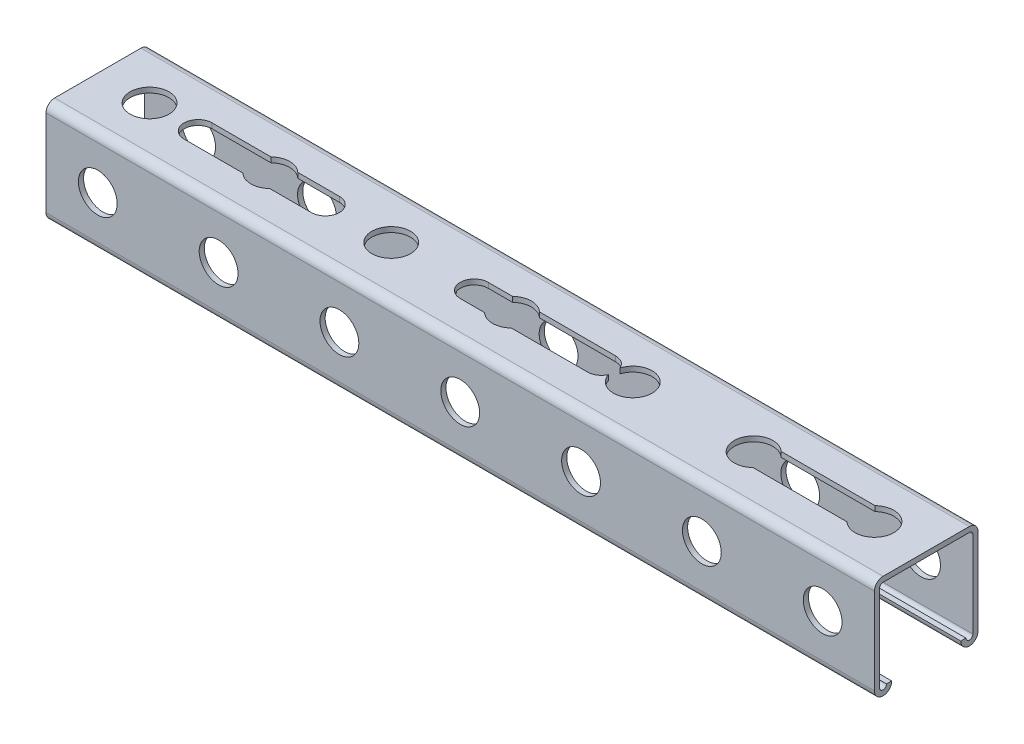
from build123d import *

# Parameters (mm, degrees)
CHANNEL_DEPTH      = 304.8
SKETCH2_R          = 7.14375
TOPHOLE_DEPTH      = 308.762168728
SKETCH3_R          = 7.14375
SIDEHOLE_DEPTH     = 570.818832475
SLOT_DEPTH         = 308.762168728
TOPHOLEPATT_COUNT  = 7
TOPHOLEPATT_PITCH  = 44.45
SIDEHOLEPATT_COUNT = 7
SIDEHOLEPATT_PITCH = 44.45
LPATTERN3_COUNT    = 3
LPATTERN3_PITCH    = 101.6


with BuildPart() as part:
    # Sketch1 → Channel (new body)
    with BuildSketch(Plane(origin=(0, 39.243400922, 0), x_dir=(0, 0, 1), z_dir=(1, 0, 0))):
        with BuildLine():
            ThreePointArc((-12.7, 74.168400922), (-15.875, 77.343400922), (-19.05, 74.168400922))
            Line((-19.05, 74.168400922), (-19.05, 42.418400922))
            ThreePointArc((-19.05, 42.418400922), (-18.12006403, 40.173336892), (-15.875, 39.243400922))
            Line((-15.875, 39.243400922), (15.875, 39.243400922))
            ThreePointArc((15.875, 39.243400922), (18.12006403, 40.173336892), (19.05, 42.418400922))
            Line((19.05, 42.418400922), (19.05, 74.168400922))
            ThreePointArc((19.05, 74.168400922), (15.875, 77.343400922), (12.7, 74.168400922))
            Line((12.7, 74.168400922), (14.605, 74.168400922))
            ThreePointArc((14.605, 74.168400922), (15.875, 75.438400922), (17.145, 74.168400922))
            Line((17.145, 74.168400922), (17.145, 42.418400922))
            ThreePointArc((17.145, 42.418400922), (16.773025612, 41.52037531), (15.875, 41.148400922))
            Line((15.875, 41.148400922), (-15.875, 41.148400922))
            ThreePointArc((-15.875, 41.148400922), (-16.773025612, 41.52037531), (-17.145, 42.418400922))
            Line((-17.145, 42.418400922), (-17.145, 74.168400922))
            ThreePointArc((-17.145, 74.168400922), (-15.875, 75.438400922), (-14.605, 74.168400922))
            Line((-14.605, 74.168400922), (-12.7, 74.168400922))
        make_face()
    extrude(amount=CHANNEL_DEPTH)

    # Sketch2 → TopHole (cut, through all)
    with BuildSketch(Plane(origin=(0, 0, 0), x_dir=(-1, 0, 0), z_dir=(0, 1, 0))):
        with Locations(Location((-285.75, 0, 0), (0, 0, 90))):
            Circle(SKETCH2_R)
    tophole = extrude(amount=-TOPHOLE_DEPTH, mode=Mode.SUBTRACT)

    # Sketch3 → SideHole (cut, through all)
    with BuildSketch(Plane(origin=(568.186596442, -17.953450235, 19.05), x_dir=(1, 0, 0), z_dir=(0, 0, 1))):
        with Locations((-282.436596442, -1.096549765)):
            Circle(SKETCH3_R)
    sidehole = extrude(amount=-SIDEHOLE_DEPTH, mode=Mode.SUBTRACT)

    # Sketch4 → Slot (cut, through all)
    with BuildSketch(Plane(origin=(0, 0, 0), x_dir=(-1, 0, 0), z_dir=(0, 1, 0))):
        with BuildLine():
            Line((-240.109375, -5.159375), (-286.940625, -5.159375))
            ThreePointArc((-286.940625, -5.159375), (-292.1, 0), (-286.940625, 5.159375))
            Line((-286.940625, 5.159375), (-240.109375, 5.159375))
            ThreePointArc((-240.109375, 5.159375), (-234.95, 0), (-240.109375, -5.159375))
        make_face()
    slot = extrude(amount=-SLOT_DEPTH, mode=Mode.SUBTRACT)

    # TopHolePatt: TopHole ×7
    with Locations(*[(-i * TOPHOLEPATT_PITCH, 0, 0) for i in range(1, TOPHOLEPATT_COUNT)]):
        add(tophole, mode=Mode.SUBTRACT)

    # SideHolePatt: SideHole ×7
    with Locations(*[(-i * SIDEHOLEPATT_PITCH, 0, 0) for i in range(1, SIDEHOLEPATT_COUNT)]):
        add(sidehole, mode=Mode.SUBTRACT)

    # LPattern3: Slot ×3
    with Locations(*[(-i * LPATTERN3_PITCH, 0, 0) for i in range(1, LPATTERN3_COUNT)]):
        add(slot, mode=Mode.SUBTRACT)


solid = part.part
